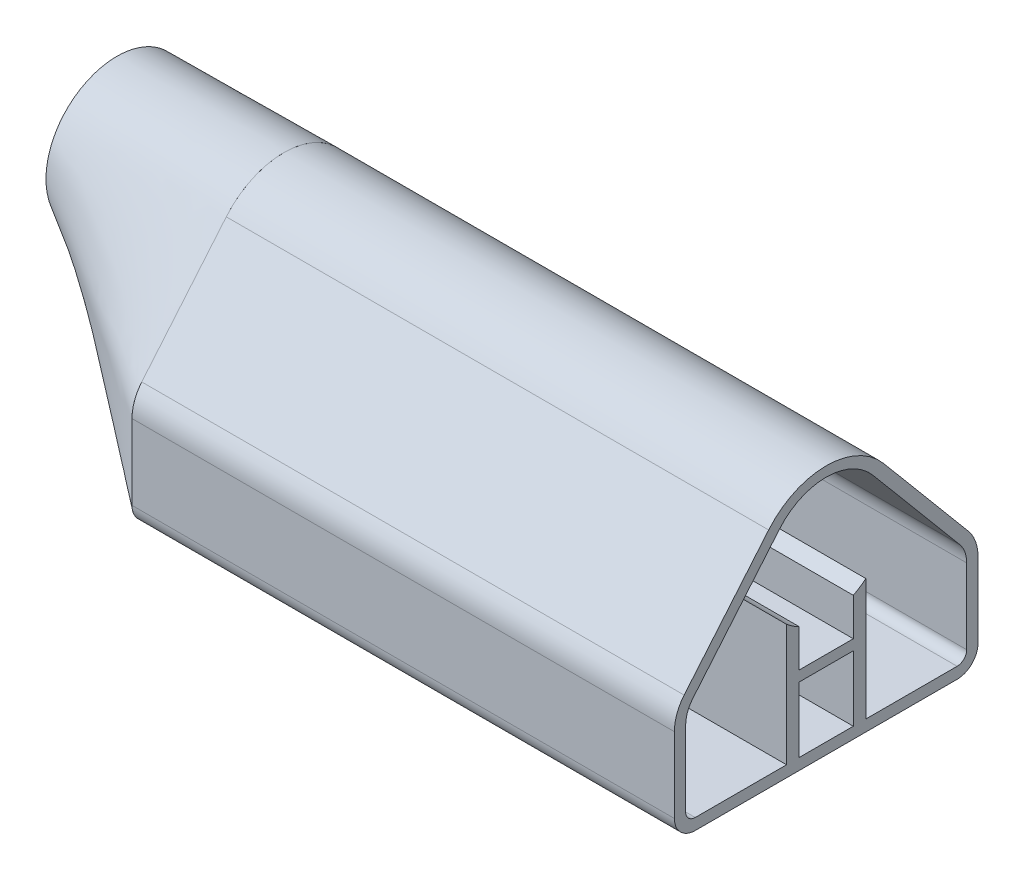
from build123d import *

# Parameters (mm, degrees)
SKIZZE4_W                       = 13
SKIZZE4_H                       = 15.662286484
AUFSATZ_LINEAR_AUSTRAGEN1_DEPTH = 130


with BuildPart() as part:
    # Skizze4 → Aufsatz-Linear austragen1 (new body)
    with BuildSketch(Plane(origin=(40, 0, 0), x_dir=(0, 0, -1), z_dir=(1, 0, 0))):
        with BuildLine():
            Line((13.788799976, 10.570176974), (34.046595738, -13.572123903))
            ThreePointArc((34.046595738, -13.572123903), (35.783077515, -16.579798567), (36.386151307, -20))
            Line((36.386151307, -20), (36.386151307, -38.019498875))
            ThreePointArc((36.386151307, -38.019498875), (34.921685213, -41.555032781), (31.386151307, -43.019498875))
            Line((31.386151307, -43.019498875), (0, -43.019498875))
            Line((0, -43.019498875), (-31.386151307, -43.019498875))
            ThreePointArc((-31.386151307, -43.019498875), (-34.921685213, -41.555032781), (-36.386151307, -38.019498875))
            Line((-36.386151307, -38.019498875), (-36.386151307, -20))
            ThreePointArc((-36.386151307, -20), (-35.783077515, -16.579798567), (-34.046595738, -13.572123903))
            Line((-34.046595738, -13.572123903), (-13.788799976, 10.570176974))
            ThreePointArc((-13.788799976, 10.570176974), (-7.607128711, 15.313540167), (0, 17))
            ThreePointArc((0, 17), (7.607128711, 15.313540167), (13.788799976, 10.570176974))
        make_face()
        with Locations((0, -32.481143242)):
            Rectangle(SKIZZE4_W, SKIZZE4_H, mode=Mode.SUBTRACT)
        with BuildLine():
            Line((-6.5, -22.15), (6.5, -22.15))
            Line((6.5, -22.15), (6.5, -13.129070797))
            ThreePointArc((6.5, -13.129070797), (8.060828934, -12.23296926), (9.5, -11.152241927))
            Line((9.5, -11.152241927), (9.5, -40.312286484))
            Line((9.5, -40.312286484), (31.386151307, -40.312286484))
            ThreePointArc((31.386151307, -40.312286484), (33.007396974, -39.640744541), (33.678938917, -38.019498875))
            Line((33.678938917, -38.019498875), (33.678938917, -20))
            ThreePointArc((33.678938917, -20), (33.239130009, -17.505719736), (31.97275073, -15.312286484))
            Line((31.97275073, -15.312286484), (11.222551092, 9.416838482))
            ThreePointArc((11.222551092, 9.416838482), (0, 14.65), (-11.222551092, 9.416838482))
            Line((-11.222551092, 9.416838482), (-31.97275073, -15.312286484))
            ThreePointArc((-31.97275073, -15.312286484), (-33.239130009, -17.505719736), (-33.678938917, -20))
            Line((-33.678938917, -20), (-33.678938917, -38.019498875))
            ThreePointArc((-33.678938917, -38.019498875), (-33.007396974, -39.640744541), (-31.386151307, -40.312286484))
            Line((-31.386151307, -40.312286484), (-9.5, -40.312286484))
            Line((-9.5, -40.312286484), (-9.5, -11.152241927))
            ThreePointArc((-9.5, -11.152241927), (-8.060828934, -12.23296926), (-6.5, -13.129070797))
            Line((-6.5, -13.129070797), (-6.5, -22.15))
        make_face(mode=Mode.SUBTRACT)
    extrude(amount=AUFSATZ_LINEAR_AUSTRAGEN1_DEPTH)


solid = part.part
